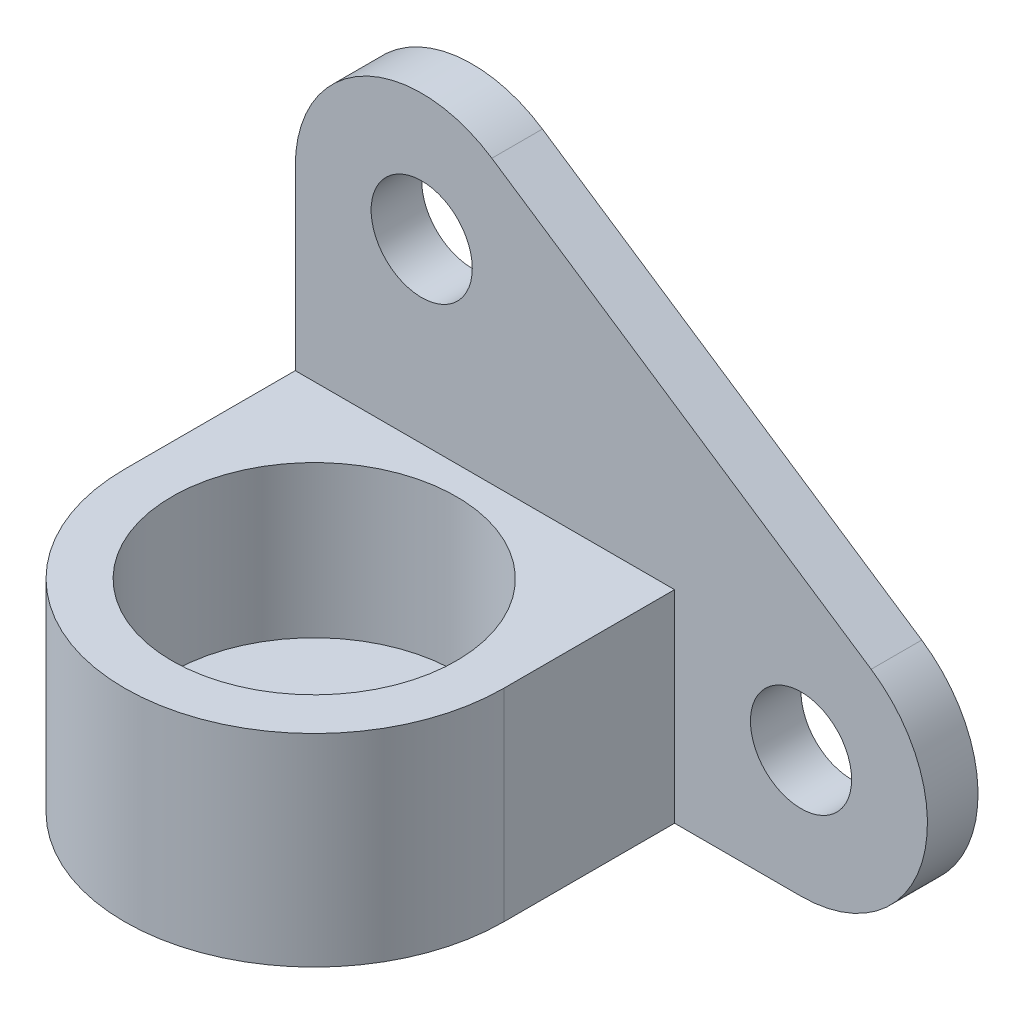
from build123d import *

# Parameters (mm, degrees)
BASE_EXTRUSION_DEPTH    = 8
BOSS_EXTRU_1_DEPTH      = 32
ESQUISSE4_R             = 22.5
ENL_V_MAT_EXTRU_1_DEPTH = 24
ESQUISSE5_R             = 9
ENL_V_MAT_EXTRU_2_DEPTH = 140.316187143
ESQUISSE6_R             = 8
ENL_V_MAT_EXTRU_3_DEPTH = 141.174890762


with BuildPart() as part:
    # Esquisse1 → Base-Extrusion (new body)
    with BuildSketch(Plane.XY):
        with BuildLine():
            Line((0, 0), (80, 0))
            ThreePointArc((80, 0), (99.14184053, 14.204317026), (91.094003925, 36.641005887))
            Line((91.094003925, 36.641005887), (31.094003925, 76.641005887))
            ThreePointArc((31.094003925, 76.641005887), (10.562841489, 77.633491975), (0, 60))
            Line((0, 60), (0, 0))
        make_face()
    extrude(amount=BASE_EXTRUSION_DEPTH)

    # Esquisse3 → Boss.-Extru.1 (add)
    with BuildSketch(Plane.XZ):
        with BuildLine():
            Line((0, 8), (60, 8))
            Line((60, 8), (60, 35))
            ThreePointArc((60, 35), (30, 65), (0, 35))
            Line((0, 35), (0, 8))
        make_face()
    extrude(amount=-BOSS_EXTRU_1_DEPTH)

    # Esquisse4 → Enl_v. mat.-Extru.1 (cut)
    with BuildSketch(Plane(origin=(0, 32, 0), x_dir=(-1, 0, 0), z_dir=(0, 1, 0))):
        with Locations(Location((-30, 35, 0), (0, 0, 90))):
            Circle(ESQUISSE4_R)
    extrude(amount=-ENL_V_MAT_EXTRU_1_DEPTH, mode=Mode.SUBTRACT)

    # Esquisse5 → Enl_v. mat.-Extru.2 (cut, through all)
    with BuildSketch(Plane(origin=(0, 8, 0), x_dir=(-1, 0, 0), z_dir=(0, 1, 0))):
        with Locations(Location((-30, 35, 0), (0, 0, 90))):
            Circle(ESQUISSE5_R)
    extrude(amount=-ENL_V_MAT_EXTRU_2_DEPTH, mode=Mode.SUBTRACT)

    # Esquisse6 → Enl_v. mat.-Extru.3 (cut, through all)
    with BuildSketch(Plane.XY.offset(8)):
        with Locations((20, 60)):
            Circle(ESQUISSE6_R)
        with Locations((80, 20)):
            Circle(ESQUISSE6_R)
    extrude(amount=-ENL_V_MAT_EXTRU_3_DEPTH, mode=Mode.SUBTRACT)


solid = part.part
